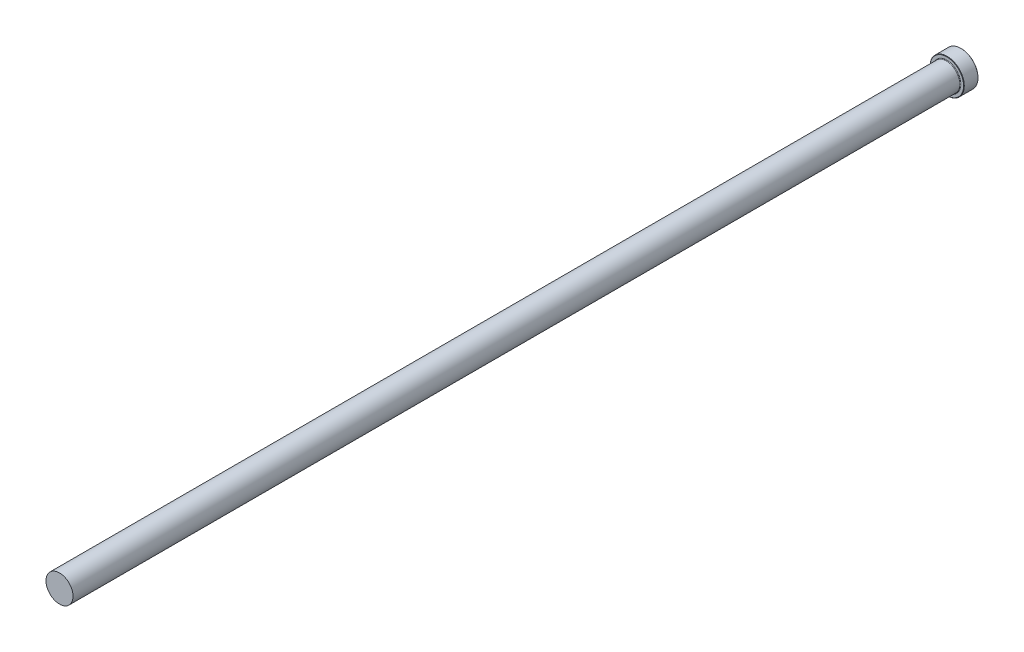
ISO-10303-21;
HEADER;
FILE_DESCRIPTION(('STEP AP214'),'2;1');
FILE_NAME('part.step','',(''),(''),'','','');
FILE_SCHEMA(('AUTOMOTIVE_DESIGN { 1 0 10303 214 1 1 1 1 }'));
ENDSEC;
DATA;
#1=APPLICATION_CONTEXT('core data for automotive mechanical design processes');
#2=APPLICATION_PROTOCOL_DEFINITION('international standard','automotive_design',2000,#1);
#3=PRODUCT_CONTEXT('',#1,'mechanical');
#4=PRODUCT('Part','Part','',(#3));
#5=PRODUCT_RELATED_PRODUCT_CATEGORY('part','',(#4));
#6=PRODUCT_DEFINITION_FORMATION('','',#4);
#7=PRODUCT_DEFINITION_CONTEXT('part definition',#1,'design');
#8=PRODUCT_DEFINITION('design','',#6,#7);
#9=PRODUCT_DEFINITION_SHAPE('','',#8);
#10=(LENGTH_UNIT() NAMED_UNIT(*) SI_UNIT(.MILLI.,.METRE.));
#11=(NAMED_UNIT(*) PLANE_ANGLE_UNIT() SI_UNIT($,.RADIAN.));
#12=(NAMED_UNIT(*) SI_UNIT($,.STERADIAN.) SOLID_ANGLE_UNIT());
#13=UNCERTAINTY_MEASURE_WITH_UNIT(LENGTH_MEASURE(1.E-05),#10,'distance_accuracy_value','');
#14=(GEOMETRIC_REPRESENTATION_CONTEXT(3) GLOBAL_UNCERTAINTY_ASSIGNED_CONTEXT((#13)) GLOBAL_UNIT_ASSIGNED_CONTEXT((#10,
#11,#12)) REPRESENTATION_CONTEXT('',''));
#15=CARTESIAN_POINT('',(0.,0.,0.));
#16=DIRECTION('',(0.,0.,1.));
#17=DIRECTION('',(1.,0.,0.));
#18=AXIS2_PLACEMENT_3D('',#15,#16,#17);
#19=CARTESIAN_POINT('',(0.,7.49999999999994,500.));
#20=DIRECTION('',(0.,0.,-1.));
#21=DIRECTION('',(-1.,0.,0.));
#22=AXIS2_PLACEMENT_3D('',#19,#20,#21);
#23=PLANE('',#22);
#24=CARTESIAN_POINT('',(0.,0.,500.));
#25=DIRECTION('',(0.,0.,1.));
#26=DIRECTION('',(1.,0.,0.));
#27=AXIS2_PLACEMENT_3D('',#24,#25,#26);
#28=CIRCLE('',#27,7.49999999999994);
#29=CARTESIAN_POINT('',(7.49999999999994,0.,500.));
#30=VERTEX_POINT('',#29);
#31=EDGE_CURVE('E50',#30,#30,#28,.T.);
#32=ORIENTED_EDGE('',*,*,#31,.T.);
#33=EDGE_LOOP('',(#32));
#34=FACE_BOUND('',#33,.T.);
#35=ADVANCED_FACE('F30',(#34),#23,.F.);
#36=CARTESIAN_POINT('',(0.,0.,109.050628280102));
#37=DIRECTION('',(0.,0.,1.));
#38=DIRECTION('',(1.,0.,0.));
#39=AXIS2_PLACEMENT_3D('',#36,#37,#38);
#40=CYLINDRICAL_SURFACE('',#39,7.49999999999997);
#41=ORIENTED_EDGE('',*,*,#31,.F.);
#42=EDGE_LOOP('',(#41));
#43=FACE_BOUND('',#42,.T.);
#44=CARTESIAN_POINT('',(0.,0.,8.3));
#45=DIRECTION('',(0.,0.,1.));
#46=DIRECTION('',(1.,0.,0.));
#47=AXIS2_PLACEMENT_3D('',#44,#45,#46);
#48=CIRCLE('',#47,7.5);
#49=CARTESIAN_POINT('',(7.5,0.,8.3));
#50=VERTEX_POINT('',#49);
#51=EDGE_CURVE('E53',#50,#50,#48,.T.);
#52=ORIENTED_EDGE('',*,*,#51,.T.);
#53=EDGE_LOOP('',(#52));
#54=FACE_BOUND('',#53,.T.);
#55=ADVANCED_FACE('F73',(#43,#54),#40,.T.);
#56=CARTESIAN_POINT('',(0.,0.,8.3));
#57=DIRECTION('',(0.,0.,1.));
#58=DIRECTION('',(1.,0.,0.));
#59=AXIS2_PLACEMENT_3D('',#56,#57,#58);
#60=TOROIDAL_SURFACE('',#59,7.8,0.3);
#61=ORIENTED_EDGE('',*,*,#51,.F.);
#62=EDGE_LOOP('',(#61));
#63=FACE_BOUND('',#62,.T.);
#64=CARTESIAN_POINT('',(0.,0.,8.00000000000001));
#65=DIRECTION('',(0.,0.,1.));
#66=DIRECTION('',(1.,0.,0.));
#67=AXIS2_PLACEMENT_3D('',#64,#65,#66);
#68=CIRCLE('',#67,7.8);
#69=CARTESIAN_POINT('',(7.8,0.,8.00000000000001));
#70=VERTEX_POINT('',#69);
#71=EDGE_CURVE('E56',#70,#70,#68,.T.);
#72=ORIENTED_EDGE('',*,*,#71,.T.);
#73=EDGE_LOOP('',(#72));
#74=FACE_BOUND('',#73,.T.);
#75=ADVANCED_FACE('F60',(#63,#74),#60,.F.);
#76=CARTESIAN_POINT('',(0.,9.5,8.));
#77=DIRECTION('',(0.,0.,-1.));
#78=DIRECTION('',(-1.,0.,0.));
#79=AXIS2_PLACEMENT_3D('',#76,#77,#78);
#80=PLANE('',#79);
#81=CARTESIAN_POINT('',(0.,0.,8.));
#82=DIRECTION('',(0.,0.,-1.));
#83=DIRECTION('',(-1.,0.,0.));
#84=AXIS2_PLACEMENT_3D('',#81,#82,#83);
#85=CIRCLE('',#84,9.30000000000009);
#86=CARTESIAN_POINT('',(-9.30000000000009,0.,8.));
#87=VERTEX_POINT('',#86);
#88=EDGE_CURVE('E10',#87,#87,#85,.F.);
#89=ORIENTED_EDGE('',*,*,#88,.T.);
#90=EDGE_LOOP('',(#89));
#91=FACE_BOUND('',#90,.T.);
#92=ORIENTED_EDGE('',*,*,#71,.F.);
#93=EDGE_LOOP('',(#92));
#94=FACE_BOUND('',#93,.T.);
#95=ADVANCED_FACE('F62',(#91,#94),#80,.F.);
#96=CARTESIAN_POINT('',(0.,0.,109.050628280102));
#97=DIRECTION('',(0.,0.,1.));
#98=DIRECTION('',(1.,0.,0.));
#99=AXIS2_PLACEMENT_3D('',#96,#97,#98);
#100=CYLINDRICAL_SURFACE('',#99,9.5);
#101=CARTESIAN_POINT('',(0.,0.,0.199999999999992));
#102=DIRECTION('',(0.,0.,1.));
#103=DIRECTION('',(1.,0.,0.));
#104=AXIS2_PLACEMENT_3D('',#101,#102,#103);
#105=CIRCLE('',#104,9.5);
#106=CARTESIAN_POINT('',(9.5,0.,0.199999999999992));
#107=VERTEX_POINT('',#106);
#108=EDGE_CURVE('E41',#107,#107,#105,.T.);
#109=ORIENTED_EDGE('',*,*,#108,.T.);
#110=EDGE_LOOP('',(#109));
#111=FACE_BOUND('',#110,.T.);
#112=CARTESIAN_POINT('',(0.,0.,7.80000000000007));
#113=DIRECTION('',(0.,0.,-1.));
#114=DIRECTION('',(-1.,0.,0.));
#115=AXIS2_PLACEMENT_3D('',#112,#113,#114);
#116=CIRCLE('',#115,9.5);
#117=CARTESIAN_POINT('',(-9.5,0.,7.80000000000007));
#118=VERTEX_POINT('',#117);
#119=EDGE_CURVE('E45',#118,#118,#116,.T.);
#120=ORIENTED_EDGE('',*,*,#119,.T.);
#121=EDGE_LOOP('',(#120));
#122=FACE_BOUND('',#121,.T.);
#123=ADVANCED_FACE('F64',(#111,#122),#100,.T.);
#124=CARTESIAN_POINT('',(0.,0.,0.));
#125=DIRECTION('',(0.,0.,1.));
#126=DIRECTION('',(1.,0.,0.));
#127=AXIS2_PLACEMENT_3D('',#124,#125,#126);
#128=PLANE('',#127);
#129=CARTESIAN_POINT('',(0.,0.,0.));
#130=DIRECTION('',(0.,0.,1.));
#131=DIRECTION('',(1.,0.,0.));
#132=AXIS2_PLACEMENT_3D('',#129,#130,#131);
#133=CIRCLE('',#132,9.30000000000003);
#134=CARTESIAN_POINT('',(9.30000000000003,0.,0.));
#135=VERTEX_POINT('',#134);
#136=EDGE_CURVE('E37',#135,#135,#133,.F.);
#137=ORIENTED_EDGE('',*,*,#136,.T.);
#138=EDGE_LOOP('',(#137));
#139=FACE_BOUND('',#138,.T.);
#140=ADVANCED_FACE('F70',(#139),#128,.F.);
#141=CARTESIAN_POINT('',(0.,0.,0.199999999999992));
#142=DIRECTION('',(0.,0.,1.));
#143=DIRECTION('',(1.,0.,0.));
#144=AXIS2_PLACEMENT_3D('',#141,#142,#143);
#145=CONICAL_SURFACE('',#144,9.5,0.785398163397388);
#146=ORIENTED_EDGE('',*,*,#136,.F.);
#147=EDGE_LOOP('',(#146));
#148=FACE_BOUND('',#147,.T.);
#149=ORIENTED_EDGE('',*,*,#108,.F.);
#150=EDGE_LOOP('',(#149));
#151=FACE_BOUND('',#150,.T.);
#152=ADVANCED_FACE('F84',(#148,#151),#145,.T.);
#153=CARTESIAN_POINT('',(0.,0.,8.00000000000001));
#154=DIRECTION('',(0.,0.,-1.));
#155=DIRECTION('',(-1.,0.,0.));
#156=AXIS2_PLACEMENT_3D('',#153,#154,#155);
#157=CONICAL_SURFACE('',#156,9.30000000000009,0.785398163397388);
#158=ORIENTED_EDGE('',*,*,#119,.F.);
#159=EDGE_LOOP('',(#158));
#160=FACE_BOUND('',#159,.T.);
#161=ORIENTED_EDGE('',*,*,#88,.F.);
#162=EDGE_LOOP('',(#161));
#163=FACE_BOUND('',#162,.T.);
#164=ADVANCED_FACE('F32',(#160,#163),#157,.T.);
#165=CLOSED_SHELL('',(#35,#55,#75,#95,#123,#140,#152,#164));
#166=MANIFOLD_SOLID_BREP('B2',#165);
#167=ADVANCED_BREP_SHAPE_REPRESENTATION('',(#18,#166),#14);
#168=SHAPE_DEFINITION_REPRESENTATION(#9,#167);
ENDSEC;
END-ISO-10303-21;
